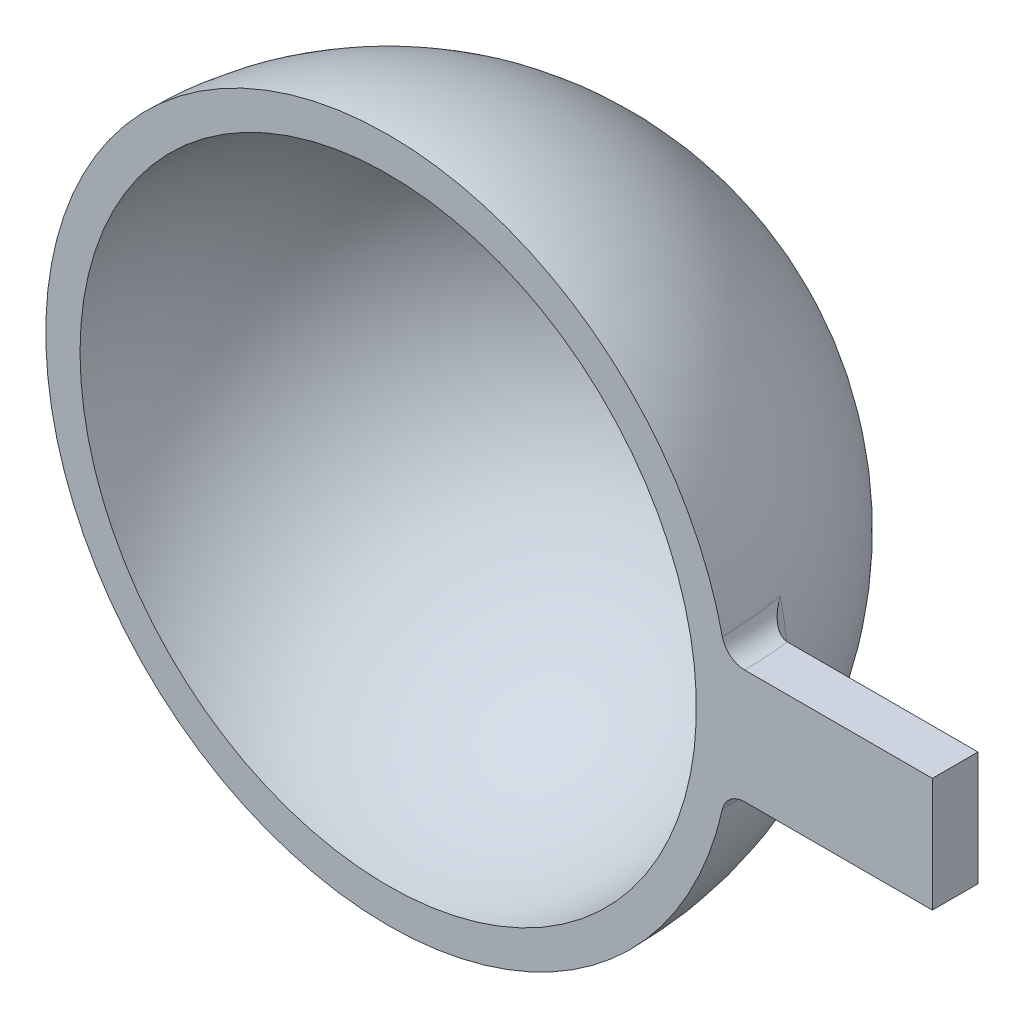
ISO-10303-21;
HEADER;
FILE_DESCRIPTION(('STEP AP214'),'2;1');
FILE_NAME('part.step','',(''),(''),'','','');
FILE_SCHEMA(('AUTOMOTIVE_DESIGN { 1 0 10303 214 1 1 1 1 }'));
ENDSEC;
DATA;
#1=APPLICATION_CONTEXT('core data for automotive mechanical design processes');
#2=APPLICATION_PROTOCOL_DEFINITION('international standard','automotive_design',2000,#1);
#3=PRODUCT_CONTEXT('',#1,'mechanical');
#4=PRODUCT('Part','Part','',(#3));
#5=PRODUCT_RELATED_PRODUCT_CATEGORY('part','',(#4));
#6=PRODUCT_DEFINITION_FORMATION('','',#4);
#7=PRODUCT_DEFINITION_CONTEXT('part definition',#1,'design');
#8=PRODUCT_DEFINITION('design','',#6,#7);
#9=PRODUCT_DEFINITION_SHAPE('','',#8);
#10=(LENGTH_UNIT() NAMED_UNIT(*) SI_UNIT(.MILLI.,.METRE.));
#11=(NAMED_UNIT(*) PLANE_ANGLE_UNIT() SI_UNIT($,.RADIAN.));
#12=(NAMED_UNIT(*) SI_UNIT($,.STERADIAN.) SOLID_ANGLE_UNIT());
#13=UNCERTAINTY_MEASURE_WITH_UNIT(LENGTH_MEASURE(1.E-05),#10,'distance_accuracy_value','');
#14=(GEOMETRIC_REPRESENTATION_CONTEXT(3) GLOBAL_UNCERTAINTY_ASSIGNED_CONTEXT((#13)) GLOBAL_UNIT_ASSIGNED_CONTEXT((#10,
#11,#12)) REPRESENTATION_CONTEXT('',''));
#15=CARTESIAN_POINT('',(0.,0.,0.));
#16=DIRECTION('',(0.,0.,1.));
#17=DIRECTION('',(1.,0.,0.));
#18=AXIS2_PLACEMENT_3D('',#15,#16,#17);
#19=CARTESIAN_POINT('',(0.,0.,0.));
#20=DIRECTION('',(0.,1.,0.));
#21=DIRECTION('',(-1.,0.,0.));
#22=AXIS2_PLACEMENT_3D('',#19,#20,#21);
#23=SPHERICAL_SURFACE('',#22,15.);
#24=CARTESIAN_POINT('',(0.,0.,-2.8125));
#25=DIRECTION('',(0.,0.,1.));
#26=DIRECTION('',(1.,0.,0.));
#27=AXIS2_PLACEMENT_3D('',#24,#25,#26);
#28=CIRCLE('',#27,14.7339690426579);
#29=CARTESIAN_POINT('',(14.3639563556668,3.28125,-2.8125));
#30=VERTEX_POINT('',#29);
#31=CARTESIAN_POINT('',(14.3639563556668,-3.28125,-2.8125));
#32=VERTEX_POINT('',#31);
#33=EDGE_CURVE('E140',#30,#32,#28,.F.);
#34=ORIENTED_EDGE('',*,*,#33,.T.);
#35=CARTESIAN_POINT('',(0.,-3.28125,0.));
#36=DIRECTION('',(0.,1.,0.));
#37=DIRECTION('',(0.,0.,1.));
#38=AXIS2_PLACEMENT_3D('',#35,#36,#37);
#39=CIRCLE('',#38,14.6367140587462);
#40=CARTESIAN_POINT('',(14.6367140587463,-3.28125,1.02207627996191E-13));
#41=VERTEX_POINT('',#40);
#42=EDGE_CURVE('E142',#32,#41,#39,.F.);
#43=ORIENTED_EDGE('',*,*,#42,.T.);
#44=CARTESIAN_POINT('',(0.,0.,0.));
#45=DIRECTION('',(0.,0.,-1.));
#46=DIRECTION('',(-1.,0.,0.));
#47=AXIS2_PLACEMENT_3D('',#44,#45,#46);
#48=CIRCLE('',#47,15.);
#49=CARTESIAN_POINT('',(14.6367140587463,3.28125,1.02207627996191E-13));
#50=VERTEX_POINT('',#49);
#51=EDGE_CURVE('E130',#41,#50,#48,.T.);
#52=ORIENTED_EDGE('',*,*,#51,.T.);
#53=CARTESIAN_POINT('',(0.,3.28125,0.));
#54=DIRECTION('',(0.,-1.,0.));
#55=DIRECTION('',(0.,0.,-1.));
#56=AXIS2_PLACEMENT_3D('',#53,#54,#55);
#57=CIRCLE('',#56,14.6367140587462);
#58=EDGE_CURVE('E138',#50,#30,#57,.F.);
#59=ORIENTED_EDGE('',*,*,#58,.T.);
#60=EDGE_LOOP('',(#34,#43,#52,#59));
#61=FACE_BOUND('',#60,.T.);
#62=ADVANCED_FACE('F32',(#61),#23,.T.);
#63=CARTESIAN_POINT('',(0.,0.,0.));
#64=DIRECTION('',(0.,1.,0.));
#65=DIRECTION('',(1.,0.,0.));
#66=AXIS2_PLACEMENT_3D('',#63,#64,#65);
#67=SPHERICAL_SURFACE('',#66,13.5);
#68=CARTESIAN_POINT('',(0.,0.,0.));
#69=DIRECTION('',(0.,0.,1.));
#70=DIRECTION('',(-1.,0.,0.));
#71=AXIS2_PLACEMENT_3D('',#68,#69,#70);
#72=SPHERICAL_SURFACE('',#71,13.5);
#73=CARTESIAN_POINT('',(0.,0.,0.));
#74=DIRECTION('',(0.,0.,1.));
#75=DIRECTION('',(-1.,0.,0.));
#76=AXIS2_PLACEMENT_3D('',#73,#74,#75);
#77=CIRCLE('',#76,13.5);
#78=CARTESIAN_POINT('',(-13.5,0.,0.));
#79=VERTEX_POINT('',#78);
#80=EDGE_CURVE('E134',#79,#79,#77,.T.);
#81=ORIENTED_EDGE('',*,*,#80,.T.);
#82=EDGE_LOOP('',(#81));
#83=FACE_BOUND('',#82,.T.);
#84=ADVANCED_FACE('F171',(#83),#72,.F.);
#85=CARTESIAN_POINT('',(0.,0.,0.));
#86=DIRECTION('',(0.,0.,-1.));
#87=DIRECTION('',(-1.,0.,0.));
#88=AXIS2_PLACEMENT_3D('',#85,#86,#87);
#89=PLANE('',#88);
#90=ORIENTED_EDGE('',*,*,#51,.F.);
#91=CARTESIAN_POINT('',(15.612494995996,-3.5,1.09021469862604E-13));
#92=DIRECTION('',(0.,0.,-1.));
#93=DIRECTION('',(-1.,0.,0.));
#94=AXIS2_PLACEMENT_3D('',#91,#92,#93);
#95=CIRCLE('',#94,1.);
#96=CARTESIAN_POINT('',(15.612494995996,-2.5,0.));
#97=VERTEX_POINT('',#96);
#98=EDGE_CURVE('E147',#41,#97,#95,.T.);
#99=ORIENTED_EDGE('',*,*,#98,.T.);
#100=DIRECTION('',(1.,0.,0.));
#101=VECTOR('',#100,1.);
#102=CARTESIAN_POINT('',(13.518911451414,-2.5,0.));
#103=LINE('',#102,#101);
#104=CARTESIAN_POINT('',(23.83545713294,-2.5,0.));
#105=VERTEX_POINT('',#104);
#106=EDGE_CURVE('E125',#97,#105,#103,.T.);
#107=ORIENTED_EDGE('',*,*,#106,.T.);
#108=DIRECTION('',(0.,1.,0.));
#109=VECTOR('',#108,1.);
#110=CARTESIAN_POINT('',(23.83545713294,2.5,0.));
#111=LINE('',#110,#109);
#112=CARTESIAN_POINT('',(23.83545713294,2.5,0.));
#113=VERTEX_POINT('',#112);
#114=EDGE_CURVE('E116',#105,#113,#111,.T.);
#115=ORIENTED_EDGE('',*,*,#114,.T.);
#116=DIRECTION('',(-1.,0.,0.));
#117=VECTOR('',#116,1.);
#118=CARTESIAN_POINT('',(13.518911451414,2.5,0.));
#119=LINE('',#118,#117);
#120=CARTESIAN_POINT('',(15.612494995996,2.5,0.));
#121=VERTEX_POINT('',#120);
#122=EDGE_CURVE('E109',#113,#121,#119,.T.);
#123=ORIENTED_EDGE('',*,*,#122,.T.);
#124=CARTESIAN_POINT('',(15.612494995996,3.5,1.09021469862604E-13));
#125=DIRECTION('',(0.,0.,-1.));
#126=DIRECTION('',(-1.,0.,0.));
#127=AXIS2_PLACEMENT_3D('',#124,#125,#126);
#128=CIRCLE('',#127,1.);
#129=EDGE_CURVE('E11',#121,#50,#128,.T.);
#130=ORIENTED_EDGE('',*,*,#129,.T.);
#131=EDGE_LOOP('',(#90,#99,#107,#115,#123,#130));
#132=FACE_BOUND('',#131,.T.);
#133=ORIENTED_EDGE('',*,*,#80,.F.);
#134=EDGE_LOOP('',(#133));
#135=FACE_BOUND('',#134,.T.);
#136=ADVANCED_FACE('F167',(#132,#135),#89,.F.);
#137=CARTESIAN_POINT('',(13.518911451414,2.5,-2.));
#138=DIRECTION('',(0.,1.,0.));
#139=DIRECTION('',(0.,0.,1.));
#140=AXIS2_PLACEMENT_3D('',#137,#138,#139);
#141=PLANE('',#140);
#142=CARTESIAN_POINT('',(15.5161206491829,2.5,-2.));
#143=CARTESIAN_POINT('',(15.510731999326,2.5,-2.00000000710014));
#144=CARTESIAN_POINT('',(15.5053440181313,2.5,-2.0000424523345));
#145=CARTESIAN_POINT('',(15.4945693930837,2.5,-2.00021221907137));
#146=CARTESIAN_POINT('',(15.4891827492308,2.5,-2.0003395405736));
#147=CARTESIAN_POINT('',(15.4837967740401,2.5,-2.00050930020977));
#148=B_SPLINE_CURVE_WITH_KNOTS('',3,(#142,#143,#144,#145,#146,#147),.UNSPECIFIED.,.F.,.F.,(4,2,
4),(0.,0.0161644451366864,0.0323288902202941),.UNSPECIFIED.);
#149=CARTESIAN_POINT('',(15.5161206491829,2.5,-2.));
#150=VERTEX_POINT('',#149);
#151=CARTESIAN_POINT('',(15.4837967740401,2.5,-2.00050930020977));
#152=VERTEX_POINT('',#151);
#153=EDGE_CURVE('E47',#150,#152,#148,.T.);
#154=ORIENTED_EDGE('',*,*,#153,.T.);
#155=CARTESIAN_POINT('',(0.,2.5,0.));
#156=DIRECTION('',(0.,1.,0.));
#157=DIRECTION('',(0.,0.,1.));
#158=AXIS2_PLACEMENT_3D('',#155,#156,#157);
#159=CIRCLE('',#158,15.612494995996);
#160=EDGE_CURVE('E55',#152,#121,#159,.F.);
#161=ORIENTED_EDGE('',*,*,#160,.T.);
#162=ORIENTED_EDGE('',*,*,#122,.F.);
#163=DIRECTION('',(0.,0.,1.));
#164=VECTOR('',#163,1.);
#165=CARTESIAN_POINT('',(23.83545713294,2.5,-2.));
#166=LINE('',#165,#164);
#167=CARTESIAN_POINT('',(23.83545713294,2.5,-2.));
#168=VERTEX_POINT('',#167);
#169=EDGE_CURVE('E117',#168,#113,#166,.T.);
#170=ORIENTED_EDGE('',*,*,#169,.F.);
#171=DIRECTION('',(-1.,0.,0.));
#172=VECTOR('',#171,1.);
#173=CARTESIAN_POINT('',(13.518911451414,2.5,-2.));
#174=LINE('',#173,#172);
#175=EDGE_CURVE('E118',#168,#150,#174,.T.);
#176=ORIENTED_EDGE('',*,*,#175,.T.);
#177=EDGE_LOOP('',(#154,#161,#162,#170,#176));
#178=FACE_BOUND('',#177,.T.);
#179=ADVANCED_FACE('F170',(#178),#141,.T.);
#180=CARTESIAN_POINT('',(23.83545713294,2.5,-2.));
#181=DIRECTION('',(1.,0.,0.));
#182=DIRECTION('',(0.,0.,-1.));
#183=AXIS2_PLACEMENT_3D('',#180,#181,#182);
#184=PLANE('',#183);
#185=ORIENTED_EDGE('',*,*,#114,.F.);
#186=DIRECTION('',(0.,0.,1.));
#187=VECTOR('',#186,1.);
#188=CARTESIAN_POINT('',(23.83545713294,-2.5,-2.));
#189=LINE('',#188,#187);
#190=CARTESIAN_POINT('',(23.83545713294,-2.5,-2.));
#191=VERTEX_POINT('',#190);
#192=EDGE_CURVE('E102',#191,#105,#189,.T.);
#193=ORIENTED_EDGE('',*,*,#192,.F.);
#194=DIRECTION('',(0.,1.,0.));
#195=VECTOR('',#194,1.);
#196=CARTESIAN_POINT('',(23.83545713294,2.5,-2.));
#197=LINE('',#196,#195);
#198=EDGE_CURVE('E108',#191,#168,#197,.T.);
#199=ORIENTED_EDGE('',*,*,#198,.T.);
#200=ORIENTED_EDGE('',*,*,#169,.T.);
#201=EDGE_LOOP('',(#185,#193,#199,#200));
#202=FACE_BOUND('',#201,.T.);
#203=ADVANCED_FACE('F113',(#202),#184,.T.);
#204=CARTESIAN_POINT('',(13.518911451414,-2.5,-2.));
#205=DIRECTION('',(0.,-1.,0.));
#206=DIRECTION('',(0.,0.,-1.));
#207=AXIS2_PLACEMENT_3D('',#204,#205,#206);
#208=PLANE('',#207);
#209=ORIENTED_EDGE('',*,*,#106,.F.);
#210=CARTESIAN_POINT('',(0.,-2.5,0.));
#211=DIRECTION('',(0.,-1.,0.));
#212=DIRECTION('',(0.,0.,-1.));
#213=AXIS2_PLACEMENT_3D('',#210,#211,#212);
#214=CIRCLE('',#213,15.612494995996);
#215=CARTESIAN_POINT('',(15.4837967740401,-2.5,-2.00050930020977));
#216=VERTEX_POINT('',#215);
#217=EDGE_CURVE('E63',#97,#216,#214,.F.);
#218=ORIENTED_EDGE('',*,*,#217,.T.);
#219=CARTESIAN_POINT('',(15.4837967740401,-2.5,-2.00050930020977));
#220=CARTESIAN_POINT('',(15.4891827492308,-2.5,-2.0003395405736));
#221=CARTESIAN_POINT('',(15.4945693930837,-2.5,-2.00021221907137));
#222=CARTESIAN_POINT('',(15.5053440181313,-2.5,-2.0000424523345));
#223=CARTESIAN_POINT('',(15.510731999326,-2.5,-2.00000000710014));
#224=CARTESIAN_POINT('',(15.5161206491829,-2.5,-2.));
#225=B_SPLINE_CURVE_WITH_KNOTS('',3,(#219,#220,#221,#222,#223,#224),.UNSPECIFIED.,.F.,.F.,(4,2,
4),(0.,0.0161644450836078,0.0323288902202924),.UNSPECIFIED.);
#226=CARTESIAN_POINT('',(15.5161206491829,-2.5,-2.));
#227=VERTEX_POINT('',#226);
#228=EDGE_CURVE('E104',#216,#227,#225,.T.);
#229=ORIENTED_EDGE('',*,*,#228,.T.);
#230=DIRECTION('',(1.,0.,0.));
#231=VECTOR('',#230,1.);
#232=CARTESIAN_POINT('',(13.518911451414,-2.5,-2.));
#233=LINE('',#232,#231);
#234=EDGE_CURVE('E99',#227,#191,#233,.T.);
#235=ORIENTED_EDGE('',*,*,#234,.T.);
#236=ORIENTED_EDGE('',*,*,#192,.T.);
#237=EDGE_LOOP('',(#209,#218,#229,#235,#236));
#238=FACE_BOUND('',#237,.T.);
#239=ADVANCED_FACE('F101',(#238),#208,.T.);
#240=CARTESIAN_POINT('',(0.,0.,-2.));
#241=DIRECTION('',(0.,0.,1.));
#242=DIRECTION('',(1.,0.,0.));
#243=AXIS2_PLACEMENT_3D('',#240,#241,#242);
#244=PLANE('',#243);
#245=ORIENTED_EDGE('',*,*,#234,.F.);
#246=CARTESIAN_POINT('',(0.,0.,-2.));
#247=DIRECTION('',(0.,0.,1.));
#248=DIRECTION('',(1.,0.,0.));
#249=AXIS2_PLACEMENT_3D('',#246,#247,#248);
#250=CIRCLE('',#249,15.7162336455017);
#251=EDGE_CURVE('E144',#227,#150,#250,.T.);
#252=ORIENTED_EDGE('',*,*,#251,.T.);
#253=ORIENTED_EDGE('',*,*,#175,.F.);
#254=ORIENTED_EDGE('',*,*,#198,.F.);
#255=EDGE_LOOP('',(#245,#252,#253,#254));
#256=FACE_BOUND('',#255,.T.);
#257=ADVANCED_FACE('F120',(#256),#244,.F.);
#258=CARTESIAN_POINT('',(0.,3.5,0.));
#259=DIRECTION('',(0.,1.,0.));
#260=DIRECTION('',(0.,0.,1.));
#261=AXIS2_PLACEMENT_3D('',#258,#259,#260);
#262=TOROIDAL_SURFACE('',#261,15.612494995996,1.);
#263=ORIENTED_EDGE('',*,*,#160,.F.);
#264=CARTESIAN_POINT('',(15.4837967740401,2.5,-2.00050930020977));
#265=CARTESIAN_POINT('',(15.4585825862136,2.49999634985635,-2.00130039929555));
#266=CARTESIAN_POINT('',(15.4334226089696,2.50093070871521,-2.00302346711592));
#267=CARTESIAN_POINT('',(15.3834508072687,2.50456425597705,-2.00821511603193));
#268=CARTESIAN_POINT('',(15.3586384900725,2.50726061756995,-2.01168089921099));
#269=CARTESIAN_POINT('',(15.28553001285,2.51774946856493,-2.02442449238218));
#270=CARTESIAN_POINT('',(15.2379693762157,2.52794715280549,-2.03607264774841));
#271=CARTESIAN_POINT('',(15.1463342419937,2.55358824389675,-2.06447737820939));
#272=CARTESIAN_POINT('',(15.1022403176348,2.56899939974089,-2.0812024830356));
#273=CARTESIAN_POINT('',(15.0175040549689,2.60406793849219,-2.11876576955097));
#274=CARTESIAN_POINT('',(14.976873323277,2.62373887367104,-2.13961705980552));
#275=CARTESIAN_POINT('',(14.8740583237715,2.68030279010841,-2.19912725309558));
#276=CARTESIAN_POINT('',(14.8150542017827,2.72007286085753,-2.24054445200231));
#277=CARTESIAN_POINT('',(14.7067092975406,2.80579241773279,-2.3292043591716));
#278=CARTESIAN_POINT('',(14.6573925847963,2.85175682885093,-2.37646111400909));
#279=CARTESIAN_POINT('',(14.558664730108,2.95786761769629,-2.48505834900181));
#280=CARTESIAN_POINT('',(14.5113080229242,3.01898935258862,-2.54729969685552));
#281=CARTESIAN_POINT('',(14.4291549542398,3.14533440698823,-2.67543416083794));
#282=CARTESIAN_POINT('',(14.3943327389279,3.21054895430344,-2.74131943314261));
#283=CARTESIAN_POINT('',(14.365132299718,3.27849347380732,-2.80972505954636));
#284=CARTESIAN_POINT('',(14.3645429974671,3.2798714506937,-2.81111229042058));
#285=CARTESIAN_POINT('',(14.3639563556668,3.28125,-2.8125));
#286=B_SPLINE_CURVE_WITH_KNOTS('',3,(#264,#265,#266,#267,#268,#269,#270,#271,#272,#273,#274,
#275,#276,#277,#278,#279,#280,#281,#282,#283,#284,#285),.UNSPECIFIED.,.F.,.F.,(4,2,2,2,2,2,2,2,
2,2,4),(0.,0.0756032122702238,0.151085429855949,0.300299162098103,0.448606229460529,
0.59739224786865,0.843000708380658,1.08921190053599,1.3859117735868,1.68199611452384,
1.68812265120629),.UNSPECIFIED.);
#287=EDGE_CURVE('E37',#30,#152,#286,.F.);
#288=ORIENTED_EDGE('',*,*,#287,.F.);
#289=ORIENTED_EDGE('',*,*,#58,.F.);
#290=ORIENTED_EDGE('',*,*,#129,.F.);
#291=EDGE_LOOP('',(#263,#288,#289,#290));
#292=FACE_BOUND('',#291,.T.);
#293=ADVANCED_FACE('F34',(#292),#262,.F.);
#294=CARTESIAN_POINT('',(0.,0.,-3.));
#295=DIRECTION('',(0.,0.,1.));
#296=DIRECTION('',(1.,0.,0.));
#297=AXIS2_PLACEMENT_3D('',#294,#295,#296);
#298=TOROIDAL_SURFACE('',#297,15.7162336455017,1.);
#299=ORIENTED_EDGE('',*,*,#251,.F.);
#300=ORIENTED_EDGE('',*,*,#228,.F.);
#301=CARTESIAN_POINT('',(15.4837967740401,-2.5,-2.00050930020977));
#302=CARTESIAN_POINT('',(15.4585825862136,-2.49999634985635,-2.00130039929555));
#303=CARTESIAN_POINT('',(15.4334226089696,-2.50093070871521,-2.00302346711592));
#304=CARTESIAN_POINT('',(15.3834508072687,-2.50456425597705,-2.00821511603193));
#305=CARTESIAN_POINT('',(15.3586384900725,-2.50726061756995,-2.01168089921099));
#306=CARTESIAN_POINT('',(15.28553001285,-2.51774946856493,-2.02442449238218));
#307=CARTESIAN_POINT('',(15.2379693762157,-2.52794715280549,-2.03607264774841));
#308=CARTESIAN_POINT('',(15.1463342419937,-2.55358824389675,-2.06447737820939));
#309=CARTESIAN_POINT('',(15.1022403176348,-2.56899939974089,-2.0812024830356));
#310=CARTESIAN_POINT('',(15.0175040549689,-2.60406793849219,-2.11876576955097));
#311=CARTESIAN_POINT('',(14.976873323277,-2.62373887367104,-2.13961705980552));
#312=CARTESIAN_POINT('',(14.8740583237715,-2.68030279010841,-2.19912725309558));
#313=CARTESIAN_POINT('',(14.8150542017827,-2.72007286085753,-2.24054445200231));
#314=CARTESIAN_POINT('',(14.7067092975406,-2.80579241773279,-2.3292043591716));
#315=CARTESIAN_POINT('',(14.6573925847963,-2.85175682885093,-2.37646111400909));
#316=CARTESIAN_POINT('',(14.558664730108,-2.95786761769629,-2.48505834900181));
#317=CARTESIAN_POINT('',(14.5113080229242,-3.01898935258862,-2.54729969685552));
#318=CARTESIAN_POINT('',(14.4291549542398,-3.14533440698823,-2.67543416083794));
#319=CARTESIAN_POINT('',(14.3943327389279,-3.21054895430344,-2.74131943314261));
#320=CARTESIAN_POINT('',(14.365132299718,-3.27849347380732,-2.80972505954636));
#321=CARTESIAN_POINT('',(14.3645429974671,-3.2798714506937,-2.81111229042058));
#322=CARTESIAN_POINT('',(14.3639563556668,-3.28125,-2.8125));
#323=B_SPLINE_CURVE_WITH_KNOTS('',3,(#301,#302,#303,#304,#305,#306,#307,#308,#309,#310,#311,
#312,#313,#314,#315,#316,#317,#318,#319,#320,#321,#322),.UNSPECIFIED.,.F.,.F.,(4,2,2,2,2,2,2,2,
2,2,4),(0.,0.0756032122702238,0.151085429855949,0.300299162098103,0.448606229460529,
0.59739224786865,0.843000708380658,1.08921190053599,1.3859117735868,1.68199611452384,
1.68812265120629),.UNSPECIFIED.);
#324=EDGE_CURVE('E258',#32,#216,#323,.F.);
#325=ORIENTED_EDGE('',*,*,#324,.F.);
#326=ORIENTED_EDGE('',*,*,#33,.F.);
#327=ORIENTED_EDGE('',*,*,#287,.T.);
#328=ORIENTED_EDGE('',*,*,#153,.F.);
#329=EDGE_LOOP('',(#299,#300,#325,#326,#327,#328));
#330=FACE_BOUND('',#329,.T.);
#331=ADVANCED_FACE('F160',(#330),#298,.F.);
#332=CARTESIAN_POINT('',(0.,-3.5,0.));
#333=DIRECTION('',(0.,-1.,0.));
#334=DIRECTION('',(0.,0.,-1.));
#335=AXIS2_PLACEMENT_3D('',#332,#333,#334);
#336=TOROIDAL_SURFACE('',#335,15.612494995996,1.);
#337=ORIENTED_EDGE('',*,*,#98,.F.);
#338=ORIENTED_EDGE('',*,*,#42,.F.);
#339=ORIENTED_EDGE('',*,*,#324,.T.);
#340=ORIENTED_EDGE('',*,*,#217,.F.);
#341=EDGE_LOOP('',(#337,#338,#339,#340));
#342=FACE_BOUND('',#341,.T.);
#343=ADVANCED_FACE('F219',(#342),#336,.F.);
#344=CLOSED_SHELL('',(#62,#84,#136,#179,#203,#239,#257,#293,#331,#343));
#345=MANIFOLD_SOLID_BREP('B2',#344);
#346=ADVANCED_BREP_SHAPE_REPRESENTATION('',(#18,#345),#14);
#347=SHAPE_DEFINITION_REPRESENTATION(#9,#346);
ENDSEC;
END-ISO-10303-21;
